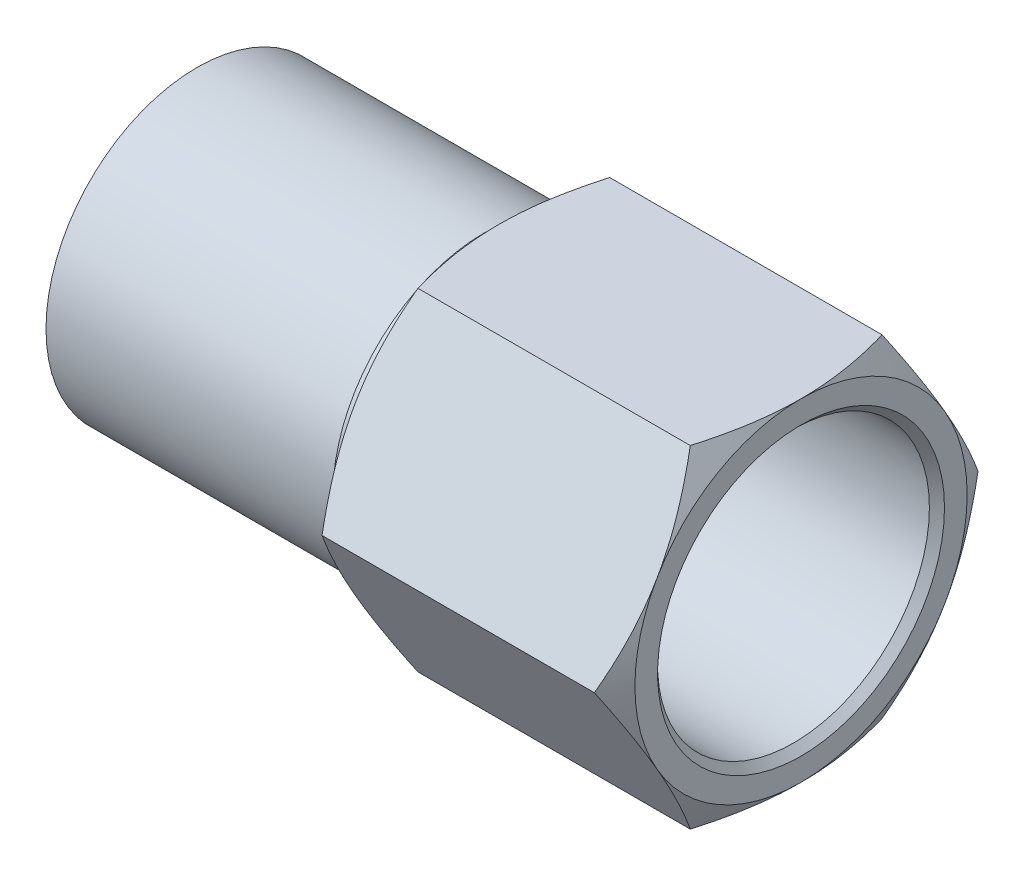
ISO-10303-21;
HEADER;
FILE_DESCRIPTION(('STEP AP214'),'2;1');
FILE_NAME('part.step','',(''),(''),'','','');
FILE_SCHEMA(('AUTOMOTIVE_DESIGN { 1 0 10303 214 1 1 1 1 }'));
ENDSEC;
DATA;
#1=APPLICATION_CONTEXT('core data for automotive mechanical design processes');
#2=APPLICATION_PROTOCOL_DEFINITION('international standard','automotive_design',2000,#1);
#3=PRODUCT_CONTEXT('',#1,'mechanical');
#4=PRODUCT('Part','Part','',(#3));
#5=PRODUCT_RELATED_PRODUCT_CATEGORY('part','',(#4));
#6=PRODUCT_DEFINITION_FORMATION('','',#4);
#7=PRODUCT_DEFINITION_CONTEXT('part definition',#1,'design');
#8=PRODUCT_DEFINITION('design','',#6,#7);
#9=PRODUCT_DEFINITION_SHAPE('','',#8);
#10=(LENGTH_UNIT() NAMED_UNIT(*) SI_UNIT(.MILLI.,.METRE.));
#11=(NAMED_UNIT(*) PLANE_ANGLE_UNIT() SI_UNIT($,.RADIAN.));
#12=(NAMED_UNIT(*) SI_UNIT($,.STERADIAN.) SOLID_ANGLE_UNIT());
#13=UNCERTAINTY_MEASURE_WITH_UNIT(LENGTH_MEASURE(1.E-05),#10,'distance_accuracy_value','');
#14=(GEOMETRIC_REPRESENTATION_CONTEXT(3) GLOBAL_UNCERTAINTY_ASSIGNED_CONTEXT((#13)) GLOBAL_UNIT_ASSIGNED_CONTEXT((#10,
#11,#12)) REPRESENTATION_CONTEXT('',''));
#15=CARTESIAN_POINT('',(0.,0.,0.));
#16=DIRECTION('',(0.,0.,1.));
#17=DIRECTION('',(1.,0.,0.));
#18=AXIS2_PLACEMENT_3D('',#15,#16,#17);
#19=CARTESIAN_POINT('',(-20.,0.,0.));
#20=DIRECTION('',(1.,0.,0.));
#21=DIRECTION('',(0.,0.,-1.));
#22=AXIS2_PLACEMENT_3D('',#19,#20,#21);
#23=CYLINDRICAL_SURFACE('',#22,10.);
#24=CARTESIAN_POINT('',(-1.,0.,0.));
#25=DIRECTION('',(1.,0.,0.));
#26=DIRECTION('',(0.,0.,-1.));
#27=AXIS2_PLACEMENT_3D('',#24,#25,#26);
#28=CIRCLE('',#27,10.);
#29=CARTESIAN_POINT('',(-1.,0.,-10.));
#30=VERTEX_POINT('',#29);
#31=EDGE_CURVE('P0_E15',#30,#30,#28,.F.);
#32=ORIENTED_EDGE('',*,*,#31,.T.);
#33=EDGE_LOOP('',(#32));
#34=FACE_BOUND('',#33,.T.);
#35=CARTESIAN_POINT('',(-20.,0.,0.));
#36=DIRECTION('',(1.,0.,0.));
#37=DIRECTION('',(0.,0.,-1.));
#38=AXIS2_PLACEMENT_3D('',#35,#36,#37);
#39=CIRCLE('',#38,10.);
#40=CARTESIAN_POINT('',(-20.,0.,-10.));
#41=VERTEX_POINT('',#40);
#42=EDGE_CURVE('P0_E10',#41,#41,#39,.T.);
#43=ORIENTED_EDGE('',*,*,#42,.T.);
#44=EDGE_LOOP('',(#43));
#45=FACE_BOUND('',#44,.T.);
#46=ADVANCED_FACE('P0_F14',(#34,#45),#23,.T.);
#47=OPEN_SHELL('',(#46));
#48=SHELL_BASED_SURFACE_MODEL('P0_B1',(#47));
#49=CARTESIAN_POINT('',(20.,0.,0.));
#50=DIRECTION('',(-1.,0.,0.));
#51=DIRECTION('',(0.,0.,1.));
#52=AXIS2_PLACEMENT_3D('',#49,#50,#51);
#53=CYLINDRICAL_SURFACE('',#52,10.);
#54=CARTESIAN_POINT('',(5.,0.,0.));
#55=DIRECTION('',(-1.,0.,0.));
#56=DIRECTION('',(0.,0.,1.));
#57=AXIS2_PLACEMENT_3D('',#54,#55,#56);
#58=CIRCLE('',#57,10.);
#59=CARTESIAN_POINT('',(5.,0.,10.));
#60=VERTEX_POINT('',#59);
#61=EDGE_CURVE('P1_E15',#60,#60,#58,.F.);
#62=ORIENTED_EDGE('',*,*,#61,.T.);
#63=EDGE_LOOP('',(#62));
#64=FACE_BOUND('',#63,.T.);
#65=CARTESIAN_POINT('',(20.,0.,0.));
#66=DIRECTION('',(-1.,0.,0.));
#67=DIRECTION('',(0.,0.,1.));
#68=AXIS2_PLACEMENT_3D('',#65,#66,#67);
#69=CIRCLE('',#68,10.);
#70=CARTESIAN_POINT('',(20.,0.,10.));
#71=VERTEX_POINT('',#70);
#72=EDGE_CURVE('P1_E10',#71,#71,#69,.T.);
#73=ORIENTED_EDGE('',*,*,#72,.T.);
#74=EDGE_LOOP('',(#73));
#75=FACE_BOUND('',#74,.T.);
#76=ADVANCED_FACE('P1_F14',(#64,#75),#53,.T.);
#77=OPEN_SHELL('',(#76));
#78=SHELL_BASED_SURFACE_MODEL('P1_B1',(#77));
#79=CARTESIAN_POINT('',(20.,0.,0.));
#80=DIRECTION('',(1.,0.,0.));
#81=DIRECTION('',(0.,0.,-1.));
#82=AXIS2_PLACEMENT_3D('',#79,#80,#81);
#83=CONICAL_SURFACE('',#82,9.5,0.785398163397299);
#84=CARTESIAN_POINT('',(19.5,0.,0.));
#85=DIRECTION('',(1.,0.,0.));
#86=DIRECTION('',(0.,0.,-1.));
#87=AXIS2_PLACEMENT_3D('',#84,#85,#86);
#88=CIRCLE('',#87,9.);
#89=CARTESIAN_POINT('',(19.5,0.,-9.));
#90=VERTEX_POINT('',#89);
#91=EDGE_CURVE('P2_E311',#90,#90,#88,.F.);
#92=ORIENTED_EDGE('',*,*,#91,.T.);
#93=EDGE_LOOP('',(#92));
#94=FACE_BOUND('',#93,.T.);
#95=CARTESIAN_POINT('',(20.,0.,0.));
#96=DIRECTION('',(1.,0.,0.));
#97=DIRECTION('',(0.,0.,-1.));
#98=AXIS2_PLACEMENT_3D('',#95,#96,#97);
#99=CIRCLE('',#98,9.5);
#100=CARTESIAN_POINT('',(20.,0.,-9.5));
#101=VERTEX_POINT('',#100);
#102=EDGE_CURVE('P2_E19',#101,#101,#99,.F.);
#103=ORIENTED_EDGE('',*,*,#102,.F.);
#104=EDGE_LOOP('',(#103));
#105=FACE_BOUND('',#104,.T.);
#106=ADVANCED_FACE('P2_F16',(#94,#105),#83,.F.);
#107=CARTESIAN_POINT('',(20.,0.,0.));
#108=DIRECTION('',(1.,0.,0.));
#109=DIRECTION('',(0.,0.,-1.));
#110=AXIS2_PLACEMENT_3D('',#107,#108,#109);
#111=CYLINDRICAL_SURFACE('',#110,9.);
#112=CARTESIAN_POINT('',(5.,0.,0.));
#113=DIRECTION('',(1.,0.,0.));
#114=DIRECTION('',(0.,0.,-1.));
#115=AXIS2_PLACEMENT_3D('',#112,#113,#114);
#116=CIRCLE('',#115,9.);
#117=CARTESIAN_POINT('',(5.,0.,-9.));
#118=VERTEX_POINT('',#117);
#119=EDGE_CURVE('P2_E111',#118,#118,#116,.T.);
#120=ORIENTED_EDGE('',*,*,#119,.F.);
#121=EDGE_LOOP('',(#120));
#122=FACE_BOUND('',#121,.T.);
#123=ORIENTED_EDGE('',*,*,#91,.F.);
#124=EDGE_LOOP('',(#123));
#125=FACE_BOUND('',#124,.T.);
#126=ADVANCED_FACE('P2_F678',(#122,#125),#111,.F.);
#127=CARTESIAN_POINT('',(20.,0.,0.));
#128=DIRECTION('',(1.,0.,0.));
#129=DIRECTION('',(0.,0.,-1.));
#130=AXIS2_PLACEMENT_3D('',#127,#128,#129);
#131=PLANE('',#130);
#132=ORIENTED_EDGE('',*,*,#102,.T.);
#133=EDGE_LOOP('',(#132));
#134=FACE_BOUND('',#133,.T.);
#135=CARTESIAN_POINT('',(20.0000000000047,0.,0.));
#136=DIRECTION('',(-1.,0.,0.));
#137=DIRECTION('',(0.,0.,1.));
#138=AXIS2_PLACEMENT_3D('',#135,#136,#137);
#139=CIRCLE('',#138,11.0000000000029);
#140=CARTESIAN_POINT('',(20.0000000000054,5.50000000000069,9.5262794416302));
#141=VERTEX_POINT('',#140);
#142=CARTESIAN_POINT('',(20.0000000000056,11.0000000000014,0.));
#143=VERTEX_POINT('',#142);
#144=EDGE_CURVE('P2_E303',#141,#143,#139,.T.);
#145=ORIENTED_EDGE('',*,*,#144,.F.);
#146=CARTESIAN_POINT('',(20.0000000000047,0.,0.));
#147=DIRECTION('',(-1.,0.,0.));
#148=DIRECTION('',(0.,0.,1.));
#149=AXIS2_PLACEMENT_3D('',#146,#147,#148);
#150=CIRCLE('',#149,11.0000000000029);
#151=CARTESIAN_POINT('',(20.000000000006,-5.50000000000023,9.52627944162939));
#152=VERTEX_POINT('',#151);
#153=EDGE_CURVE('P2_E107',#152,#141,#150,.T.);
#154=ORIENTED_EDGE('',*,*,#153,.F.);
#155=CARTESIAN_POINT('',(20.0000000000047,0.,0.));
#156=DIRECTION('',(-1.,0.,0.));
#157=DIRECTION('',(0.,0.,1.));
#158=AXIS2_PLACEMENT_3D('',#155,#156,#157);
#159=CIRCLE('',#158,11.0000000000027);
#160=CARTESIAN_POINT('',(20.0000000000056,-11.0000000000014,0.));
#161=VERTEX_POINT('',#160);
#162=EDGE_CURVE('P2_E101',#161,#152,#159,.T.);
#163=ORIENTED_EDGE('',*,*,#162,.F.);
#164=CARTESIAN_POINT('',(20.0000000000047,0.,0.));
#165=DIRECTION('',(-1.,0.,0.));
#166=DIRECTION('',(0.,0.,1.));
#167=AXIS2_PLACEMENT_3D('',#164,#165,#166);
#168=CIRCLE('',#167,11.0000000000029);
#169=CARTESIAN_POINT('',(20.0000000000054,-5.50000000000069,-9.5262794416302));
#170=VERTEX_POINT('',#169);
#171=EDGE_CURVE('P2_E104',#170,#161,#168,.T.);
#172=ORIENTED_EDGE('',*,*,#171,.F.);
#173=CARTESIAN_POINT('',(20.0000000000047,0.,0.));
#174=DIRECTION('',(-1.,0.,0.));
#175=DIRECTION('',(0.,0.,1.));
#176=AXIS2_PLACEMENT_3D('',#173,#174,#175);
#177=CIRCLE('',#176,11.0000000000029);
#178=CARTESIAN_POINT('',(20.000000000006,5.50000000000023,-9.52627944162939));
#179=VERTEX_POINT('',#178);
#180=EDGE_CURVE('P2_E122',#179,#170,#177,.T.);
#181=ORIENTED_EDGE('',*,*,#180,.F.);
#182=CARTESIAN_POINT('',(20.0000000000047,0.,0.));
#183=DIRECTION('',(-1.,0.,0.));
#184=DIRECTION('',(0.,0.,1.));
#185=AXIS2_PLACEMENT_3D('',#182,#183,#184);
#186=CIRCLE('',#185,11.0000000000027);
#187=EDGE_CURVE('P2_E300',#143,#179,#186,.T.);
#188=ORIENTED_EDGE('',*,*,#187,.F.);
#189=EDGE_LOOP('',(#145,#154,#163,#172,#181,#188));
#190=FACE_BOUND('',#189,.T.);
#191=ADVANCED_FACE('P2_F103',(#134,#190),#131,.T.);
#192=CARTESIAN_POINT('',(5.,0.,0.));
#193=DIRECTION('',(1.,0.,0.));
#194=DIRECTION('',(0.,0.,-1.));
#195=AXIS2_PLACEMENT_3D('',#192,#193,#194);
#196=PLANE('',#195);
#197=CARTESIAN_POINT('',(5.,0.,0.));
#198=DIRECTION('',(1.,0.,0.));
#199=DIRECTION('',(0.,0.,-1.));
#200=AXIS2_PLACEMENT_3D('',#197,#198,#199);
#201=CIRCLE('',#200,4.);
#202=CARTESIAN_POINT('',(5.,0.,-4.));
#203=VERTEX_POINT('',#202);
#204=EDGE_CURVE('P2_E297',#203,#203,#201,.F.);
#205=ORIENTED_EDGE('',*,*,#204,.T.);
#206=EDGE_LOOP('',(#205));
#207=FACE_BOUND('',#206,.T.);
#208=ORIENTED_EDGE('',*,*,#119,.T.);
#209=EDGE_LOOP('',(#208));
#210=FACE_BOUND('',#209,.T.);
#211=ADVANCED_FACE('P2_F662',(#207,#210),#196,.T.);
#212=CARTESIAN_POINT('',(19.0116247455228,0.,0.));
#213=DIRECTION('',(-1.,0.,0.));
#214=DIRECTION('',(0.,0.,1.));
#215=AXIS2_PLACEMENT_3D('',#212,#213,#214);
#216=CONICAL_SURFACE('',#215,12.7119161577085,1.0471975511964);
#217=CARTESIAN_POINT('',(20.0000000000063,-11.,0.));
#218=CARTESIAN_POINT('',(20.000045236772,-11.,0.269557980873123));
#219=CARTESIAN_POINT('',(19.9942806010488,-11.,0.539103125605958));
#220=CARTESIAN_POINT('',(19.9714665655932,-11.,1.07766415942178));
#221=CARTESIAN_POINT('',(19.9544193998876,-11.,1.34668014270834));
#222=CARTESIAN_POINT('',(19.9094875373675,-11.,1.88244492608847));
#223=CARTESIAN_POINT('',(19.8816573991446,-11.,2.14919833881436));
#224=CARTESIAN_POINT('',(19.8157540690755,-11.,2.68143544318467));
#225=CARTESIAN_POINT('',(19.7776806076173,-11.,2.94691910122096));
#226=CARTESIAN_POINT('',(19.6920670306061,-11.,3.47602104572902));
#227=CARTESIAN_POINT('',(19.6445383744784,-11.,3.73964119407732));
#228=CARTESIAN_POINT('',(19.540795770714,-11.,4.26516474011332));
#229=CARTESIAN_POINT('',(19.4845812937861,-11.,4.52706803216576));
#230=CARTESIAN_POINT('',(19.3035576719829,-11.,5.31266890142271));
#231=CARTESIAN_POINT('',(19.1668042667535,-11.,5.83365891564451));
#232=CARTESIAN_POINT('',(19.0175196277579,-11.,6.35085296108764));
#233=B_SPLINE_CURVE_WITH_KNOTS('',3,(#217,#218,#219,#220,#221,#222,#223,#224,#225,#226,#227,
#228,#229,#230,#231,#232),.UNSPECIFIED.,.F.,.F.,(4,2,2,2,2,2,2,4),(0.,0.80859171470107,
1.61702336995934,2.42141692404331,3.22583165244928,4.02927732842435,4.83277198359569,
6.44765263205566),.UNSPECIFIED.);
#234=CARTESIAN_POINT('',(19.0175196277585,-11.0000000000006,6.35085296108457));
#235=VERTEX_POINT('',#234);
#236=EDGE_CURVE('P2_E125',#161,#235,#233,.T.);
#237=ORIENTED_EDGE('',*,*,#236,.F.);
#238=ORIENTED_EDGE('',*,*,#162,.T.);
#239=CARTESIAN_POINT('',(19.0175196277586,-11.0000000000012,6.35085296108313));
#240=CARTESIAN_POINT('',(19.1668042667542,-10.5520968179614,6.60944998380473));
#241=CARTESIAN_POINT('',(19.3035576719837,-10.1009062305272,6.86994499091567));
#242=CARTESIAN_POINT('',(19.484581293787,-9.42055592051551,7.2627454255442));
#243=CARTESIAN_POINT('',(19.5407957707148,-9.1937410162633,7.39369707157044));
#244=CARTESIAN_POINT('',(19.6445383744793,-8.73862427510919,7.65645884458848));
#245=CARTESIAN_POINT('',(19.692067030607,-8.51032252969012,7.78826891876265));
#246=CARTESIAN_POINT('',(19.7776806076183,-8.05210680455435,8.05281989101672));
#247=CARTESIAN_POINT('',(19.8157540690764,-7.82219121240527,8.18556172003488));
#248=CARTESIAN_POINT('',(19.8816573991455,-7.36126035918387,8.45168027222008));
#249=CARTESIAN_POINT('',(19.9094875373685,-7.13024512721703,8.58505697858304));
#250=CARTESIAN_POINT('',(19.9544193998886,-6.66625921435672,8.85293937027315));
#251=CARTESIAN_POINT('',(19.9714665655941,-6.43328453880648,8.98744736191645));
#252=CARTESIAN_POINT('',(19.9942806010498,-5.96687700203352,9.2567278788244));
#253=CARTESIAN_POINT('',(20.000045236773,-5.73344405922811,9.39150045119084));
#254=CARTESIAN_POINT('',(20.0000000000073,-5.4999999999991,9.52627944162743));
#255=B_SPLINE_CURVE_WITH_KNOTS('',3,(#239,#240,#241,#242,#243,#244,#245,#246,#247,#248,#249,
#250,#251,#252,#253,#254),.UNSPECIFIED.,.F.,.F.,(4,2,2,2,2,2,2,4),(0.,1.61488064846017,
2.41837530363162,3.22182097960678,4.02623570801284,4.83062926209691,5.63906091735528,
6.44765263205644),.UNSPECIFIED.);
#256=EDGE_CURVE('P2_E128',#235,#152,#255,.T.);
#257=ORIENTED_EDGE('',*,*,#256,.F.);
#258=EDGE_LOOP('',(#237,#238,#257));
#259=FACE_BOUND('',#258,.T.);
#260=ADVANCED_FACE('P2_F126',(#259),#216,.T.);
#261=CARTESIAN_POINT('',(19.0116247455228,0.,0.));
#262=DIRECTION('',(-1.,0.,0.));
#263=DIRECTION('',(0.,0.,1.));
#264=AXIS2_PLACEMENT_3D('',#261,#262,#263);
#265=CONICAL_SURFACE('',#264,12.7119161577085,1.0471975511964);
#266=CARTESIAN_POINT('',(20.0000000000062,-5.5,-9.52627944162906));
#267=CARTESIAN_POINT('',(20.0000452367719,-5.733444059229,-9.39150045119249));
#268=CARTESIAN_POINT('',(19.9942806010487,-5.96687700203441,-9.25672787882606));
#269=CARTESIAN_POINT('',(19.9714665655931,-6.43328453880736,-8.98744736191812));
#270=CARTESIAN_POINT('',(19.9544193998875,-6.66625921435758,-8.85293937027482));
#271=CARTESIAN_POINT('',(19.9094875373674,-7.13024512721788,-8.58505697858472));
#272=CARTESIAN_POINT('',(19.8816573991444,-7.36126035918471,-8.45168027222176));
#273=CARTESIAN_POINT('',(19.8157540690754,-7.8221912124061,-8.18556172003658));
#274=CARTESIAN_POINT('',(19.7776806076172,-8.05210680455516,-8.05281989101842));
#275=CARTESIAN_POINT('',(19.6920670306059,-8.51032252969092,-7.78826891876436));
#276=CARTESIAN_POINT('',(19.6445383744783,-8.73862427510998,-7.6564588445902));
#277=CARTESIAN_POINT('',(19.5407957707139,-9.19374101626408,-7.39369707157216));
#278=CARTESIAN_POINT('',(19.484581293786,-9.42055592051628,-7.26274542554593));
#279=CARTESIAN_POINT('',(19.3035576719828,-10.100906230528,-6.86994499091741));
#280=CARTESIAN_POINT('',(19.1668042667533,-10.5520968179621,-6.60944998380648));
#281=CARTESIAN_POINT('',(19.0175196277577,-11.0000000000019,-6.35085296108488));
#282=B_SPLINE_CURVE_WITH_KNOTS('',3,(#266,#267,#268,#269,#270,#271,#272,#273,#274,#275,#276,
#277,#278,#279,#280,#281),.UNSPECIFIED.,.F.,.F.,(4,2,2,2,2,2,2,4),(0.,0.808591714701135,
1.61702336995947,2.42141692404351,3.22583165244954,4.02927732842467,4.83277198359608,
6.44765263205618),.UNSPECIFIED.);
#283=CARTESIAN_POINT('',(19.0175196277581,-11.,-6.35085296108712));
#284=VERTEX_POINT('',#283);
#285=EDGE_CURVE('P2_E120',#170,#284,#282,.T.);
#286=ORIENTED_EDGE('',*,*,#285,.F.);
#287=ORIENTED_EDGE('',*,*,#171,.T.);
#288=CARTESIAN_POINT('',(19.0175196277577,-11.,-6.35085296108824));
#289=CARTESIAN_POINT('',(19.1668042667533,-11.,-5.83365891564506));
#290=CARTESIAN_POINT('',(19.3035576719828,-11.,-5.31266890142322));
#291=CARTESIAN_POINT('',(19.484581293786,-11.,-4.52706803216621));
#292=CARTESIAN_POINT('',(19.5407957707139,-11.,-4.26516474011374));
#293=CARTESIAN_POINT('',(19.6445383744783,-11.,-3.73964119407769));
#294=CARTESIAN_POINT('',(19.692067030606,-11.,-3.47602104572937));
#295=CARTESIAN_POINT('',(19.7776806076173,-11.,-2.94691910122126));
#296=CARTESIAN_POINT('',(19.8157540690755,-11.,-2.68143544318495));
#297=CARTESIAN_POINT('',(19.8816573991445,-11.,-2.14919833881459));
#298=CARTESIAN_POINT('',(19.9094875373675,-11.,-1.88244492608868));
#299=CARTESIAN_POINT('',(19.9544193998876,-11.,-1.3466801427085));
#300=CARTESIAN_POINT('',(19.9714665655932,-11.,-1.07766415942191));
#301=CARTESIAN_POINT('',(19.9942806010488,-11.,-0.539103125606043));
#302=CARTESIAN_POINT('',(20.000045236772,-11.,-0.269557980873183));
#303=CARTESIAN_POINT('',(20.0000000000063,-11.,0.));
#304=B_SPLINE_CURVE_WITH_KNOTS('',3,(#288,#289,#290,#291,#292,#293,#294,#295,#296,#297,#298,
#299,#300,#301,#302,#303),.UNSPECIFIED.,.F.,.F.,(4,2,2,2,2,2,2,4),(0.,1.61488064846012,
2.41837530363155,3.22182097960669,4.02623570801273,4.83062926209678,5.63906091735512,
6.44765263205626),.UNSPECIFIED.);
#305=EDGE_CURVE('P2_E117',#284,#161,#304,.T.);
#306=ORIENTED_EDGE('',*,*,#305,.F.);
#307=EDGE_LOOP('',(#286,#287,#306));
#308=FACE_BOUND('',#307,.T.);
#309=ADVANCED_FACE('P2_F115',(#308),#265,.T.);
#310=CARTESIAN_POINT('',(19.0116247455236,0.,0.));
#311=DIRECTION('',(-1.,0.,0.));
#312=DIRECTION('',(0.,0.,1.));
#313=AXIS2_PLACEMENT_3D('',#310,#311,#312);
#314=CONICAL_SURFACE('',#313,12.7119161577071,1.0471975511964);
#315=CARTESIAN_POINT('',(20.0000000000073,5.4999999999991,-9.52627944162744));
#316=CARTESIAN_POINT('',(20.0000452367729,5.2665559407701,-9.66105843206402));
#317=CARTESIAN_POINT('',(19.9942806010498,5.0331229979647,-9.79583100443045));
#318=CARTESIAN_POINT('',(19.9714665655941,4.56671546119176,-10.0651115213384));
#319=CARTESIAN_POINT('',(19.9544193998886,4.33374078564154,-10.1996195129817));
#320=CARTESIAN_POINT('',(19.9094875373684,3.86975487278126,-10.4675019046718));
#321=CARTESIAN_POINT('',(19.8816573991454,3.63873964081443,-10.6008786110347));
#322=CARTESIAN_POINT('',(19.8157540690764,3.17780878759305,-10.8669971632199));
#323=CARTESIAN_POINT('',(19.7776806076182,2.94789319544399,-10.9997389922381));
#324=CARTESIAN_POINT('',(19.6920670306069,2.48967747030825,-11.2642899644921));
#325=CARTESIAN_POINT('',(19.6445383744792,2.26137572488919,-11.3961000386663));
#326=CARTESIAN_POINT('',(19.5407957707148,1.8062589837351,-11.6588618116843));
#327=CARTESIAN_POINT('',(19.4845812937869,1.57944407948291,-11.7898134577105));
#328=CARTESIAN_POINT('',(19.3035576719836,0.899093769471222,-12.1826138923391));
#329=CARTESIAN_POINT('',(19.1668042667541,0.447903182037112,-12.44310889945));
#330=CARTESIAN_POINT('',(19.0175196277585,-2.69836580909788E-12,-12.7017059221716));
#331=B_SPLINE_CURVE_WITH_KNOTS('',3,(#315,#316,#317,#318,#319,#320,#321,#322,#323,#324,#325,
#326,#327,#328,#329,#330),.UNSPECIFIED.,.F.,.F.,(4,2,2,2,2,2,2,4),(0.,0.808591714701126,
1.61702336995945,2.42141692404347,3.22583165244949,4.02927732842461,4.83277198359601,
6.4476526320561),.UNSPECIFIED.);
#332=CARTESIAN_POINT('',(19.0175196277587,5.1315977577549E-13,-12.7017059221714));
#333=VERTEX_POINT('',#332);
#334=EDGE_CURVE('P2_E417',#179,#333,#331,.T.);
#335=ORIENTED_EDGE('',*,*,#334,.F.);
#336=ORIENTED_EDGE('',*,*,#180,.T.);
#337=CARTESIAN_POINT('',(19.0175196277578,1.02659279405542E-12,-12.7017059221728));
#338=CARTESIAN_POINT('',(19.1668042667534,-0.447903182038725,-12.4431088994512));
#339=CARTESIAN_POINT('',(19.3035576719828,-0.899093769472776,-12.1826138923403));
#340=CARTESIAN_POINT('',(19.484581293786,-1.57944407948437,-11.7898134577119));
#341=CARTESIAN_POINT('',(19.5407957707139,-1.80625898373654,-11.6588618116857));
#342=CARTESIAN_POINT('',(19.6445383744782,-2.26137572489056,-11.3961000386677));
#343=CARTESIAN_POINT('',(19.6920670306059,-2.48967747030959,-11.2642899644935));
#344=CARTESIAN_POINT('',(19.7776806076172,-2.94789319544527,-10.9997389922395));
#345=CARTESIAN_POINT('',(19.8157540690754,-3.1778087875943,-10.8669971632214));
#346=CARTESIAN_POINT('',(19.8816573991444,-3.63873964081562,-10.6008786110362));
#347=CARTESIAN_POINT('',(19.9094875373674,-3.86975487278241,-10.4675019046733));
#348=CARTESIAN_POINT('',(19.9544193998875,-4.33374078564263,-10.1996195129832));
#349=CARTESIAN_POINT('',(19.971466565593,-4.56671546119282,-10.06511152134));
#350=CARTESIAN_POINT('',(19.9942806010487,-5.03312299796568,-9.79583100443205));
#351=CARTESIAN_POINT('',(20.0000452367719,-5.26655594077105,-9.66105843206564));
#352=CARTESIAN_POINT('',(20.0000000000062,-5.5,-9.52627944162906));
#353=B_SPLINE_CURVE_WITH_KNOTS('',3,(#337,#338,#339,#340,#341,#342,#343,#344,#345,#346,#347,
#348,#349,#350,#351,#352),.UNSPECIFIED.,.F.,.F.,(4,2,2,2,2,2,2,4),(0.,1.61488064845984,
2.41837530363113,3.22182097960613,4.02623570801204,4.83062926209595,5.63906091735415,
6.44765263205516),.UNSPECIFIED.);
#354=EDGE_CURVE('P2_E176',#333,#170,#353,.T.);
#355=ORIENTED_EDGE('',*,*,#354,.F.);
#356=EDGE_LOOP('',(#335,#336,#355));
#357=FACE_BOUND('',#356,.T.);
#358=ADVANCED_FACE('P2_F164',(#357),#314,.T.);
#359=CARTESIAN_POINT('',(19.0116247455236,0.,0.));
#360=DIRECTION('',(-1.,0.,0.));
#361=DIRECTION('',(0.,0.,1.));
#362=AXIS2_PLACEMENT_3D('',#359,#360,#361);
#363=CONICAL_SURFACE('',#362,12.7119161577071,1.0471975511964);
#364=CARTESIAN_POINT('',(20.0000000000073,-5.4999999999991,9.52627944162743));
#365=CARTESIAN_POINT('',(20.0000452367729,-5.2665559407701,9.66105843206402));
#366=CARTESIAN_POINT('',(19.9942806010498,-5.03312299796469,9.79583100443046));
#367=CARTESIAN_POINT('',(19.9714665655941,-4.56671546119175,10.0651115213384));
#368=CARTESIAN_POINT('',(19.9544193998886,-4.33374078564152,10.1996195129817));
#369=CARTESIAN_POINT('',(19.9094875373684,-3.86975487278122,10.4675019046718));
#370=CARTESIAN_POINT('',(19.8816573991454,-3.63873964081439,10.6008786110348));
#371=CARTESIAN_POINT('',(19.8157540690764,-3.177808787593,10.8669971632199));
#372=CARTESIAN_POINT('',(19.7776806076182,-2.94789319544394,10.9997389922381));
#373=CARTESIAN_POINT('',(19.6920670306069,-2.48967747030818,11.2642899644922));
#374=CARTESIAN_POINT('',(19.6445383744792,-2.26137572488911,11.3961000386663));
#375=CARTESIAN_POINT('',(19.5407957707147,-1.80625898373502,11.6588618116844));
#376=CARTESIAN_POINT('',(19.4845812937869,-1.57944407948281,11.7898134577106));
#377=CARTESIAN_POINT('',(19.3035576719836,-0.899093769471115,12.1826138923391));
#378=CARTESIAN_POINT('',(19.1668042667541,-0.447903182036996,12.44310889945));
#379=CARTESIAN_POINT('',(19.0175196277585,2.82988278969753E-12,12.7017059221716));
#380=B_SPLINE_CURVE_WITH_KNOTS('',3,(#364,#365,#366,#367,#368,#369,#370,#371,#372,#373,#374,
#375,#376,#377,#378,#379),.UNSPECIFIED.,.F.,.F.,(4,2,2,2,2,2,2,4),(0.,0.808591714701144,
1.61702336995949,2.42141692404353,3.22583165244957,4.02927732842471,4.83277198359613,
6.44765263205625),.UNSPECIFIED.);
#381=CARTESIAN_POINT('',(19.0175196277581,8.36742042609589E-13,12.7017059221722));
#382=VERTEX_POINT('',#381);
#383=EDGE_CURVE('P2_E137',#152,#382,#380,.T.);
#384=ORIENTED_EDGE('',*,*,#383,.F.);
#385=ORIENTED_EDGE('',*,*,#153,.T.);
#386=CARTESIAN_POINT('',(19.0175196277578,-1.15623173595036E-12,12.7017059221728));
#387=CARTESIAN_POINT('',(19.1668042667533,0.447903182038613,12.4431088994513));
#388=CARTESIAN_POINT('',(19.3035576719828,0.899093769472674,12.1826138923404));
#389=CARTESIAN_POINT('',(19.484581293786,1.57944407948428,11.7898134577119));
#390=CARTESIAN_POINT('',(19.5407957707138,1.80625898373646,11.6588618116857));
#391=CARTESIAN_POINT('',(19.6445383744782,2.26137572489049,11.3961000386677));
#392=CARTESIAN_POINT('',(19.6920670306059,2.48967747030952,11.2642899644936));
#393=CARTESIAN_POINT('',(19.7776806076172,2.94789319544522,10.9997389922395));
#394=CARTESIAN_POINT('',(19.8157540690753,3.17780878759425,10.8669971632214));
#395=CARTESIAN_POINT('',(19.8816573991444,3.63873964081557,10.6008786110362));
#396=CARTESIAN_POINT('',(19.9094875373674,3.86975487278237,10.4675019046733));
#397=CARTESIAN_POINT('',(19.9544193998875,4.3337407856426,10.1996195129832));
#398=CARTESIAN_POINT('',(19.971466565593,4.56671546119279,10.06511152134));
#399=CARTESIAN_POINT('',(19.9942806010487,5.03312299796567,9.79583100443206));
#400=CARTESIAN_POINT('',(20.0000452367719,5.26655594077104,9.66105843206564));
#401=CARTESIAN_POINT('',(20.0000000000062,5.5,9.52627944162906));
#402=B_SPLINE_CURVE_WITH_KNOTS('',3,(#386,#387,#388,#389,#390,#391,#392,#393,#394,#395,#396,
#397,#398,#399,#400,#401),.UNSPECIFIED.,.F.,.F.,(4,2,2,2,2,2,2,4),(0.,1.61488064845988,
2.41837530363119,3.22182097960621,4.02623570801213,4.83062926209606,5.63906091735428,
6.44765263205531),.UNSPECIFIED.);
#403=EDGE_CURVE('P2_E410',#382,#141,#402,.T.);
#404=ORIENTED_EDGE('',*,*,#403,.F.);
#405=EDGE_LOOP('',(#384,#385,#404));
#406=FACE_BOUND('',#405,.T.);
#407=ADVANCED_FACE('P2_F399',(#406),#363,.T.);
#408=CARTESIAN_POINT('',(19.0116247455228,0.,0.));
#409=DIRECTION('',(-1.,0.,0.));
#410=DIRECTION('',(0.,0.,1.));
#411=AXIS2_PLACEMENT_3D('',#408,#409,#410);
#412=CONICAL_SURFACE('',#411,12.7119161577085,1.0471975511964);
#413=CARTESIAN_POINT('',(20.0000000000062,5.5,9.52627944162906));
#414=CARTESIAN_POINT('',(20.0000452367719,5.733444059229,9.39150045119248));
#415=CARTESIAN_POINT('',(19.9942806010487,5.96687700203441,9.25672787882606));
#416=CARTESIAN_POINT('',(19.9714665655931,6.43328453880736,8.98744736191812));
#417=CARTESIAN_POINT('',(19.9544193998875,6.66625921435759,8.85293937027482));
#418=CARTESIAN_POINT('',(19.9094875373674,7.13024512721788,8.58505697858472));
#419=CARTESIAN_POINT('',(19.8816573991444,7.36126035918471,8.45168027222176));
#420=CARTESIAN_POINT('',(19.8157540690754,7.8221912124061,8.18556172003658));
#421=CARTESIAN_POINT('',(19.7776806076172,8.05210680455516,8.05281989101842));
#422=CARTESIAN_POINT('',(19.6920670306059,8.51032252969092,7.78826891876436));
#423=CARTESIAN_POINT('',(19.6445383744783,8.73862427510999,7.65645884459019));
#424=CARTESIAN_POINT('',(19.5407957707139,9.19374101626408,7.39369707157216));
#425=CARTESIAN_POINT('',(19.484581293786,9.42055592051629,7.26274542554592));
#426=CARTESIAN_POINT('',(19.3035576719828,10.100906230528,6.8699449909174));
#427=CARTESIAN_POINT('',(19.1668042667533,10.5520968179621,6.60944998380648));
#428=CARTESIAN_POINT('',(19.0175196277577,11.0000000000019,6.35085296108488));
#429=B_SPLINE_CURVE_WITH_KNOTS('',3,(#413,#414,#415,#416,#417,#418,#419,#420,#421,#422,#423,
#424,#425,#426,#427,#428),.UNSPECIFIED.,.F.,.F.,(4,2,2,2,2,2,2,4),(0.,0.808591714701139,
1.61702336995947,2.42141692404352,3.22583165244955,4.02927732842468,4.83277198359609,
6.4476526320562),.UNSPECIFIED.);
#430=CARTESIAN_POINT('',(19.0175196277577,11.000000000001,6.35085296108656));
#431=VERTEX_POINT('',#430);
#432=EDGE_CURVE('P2_E403',#141,#431,#429,.T.);
#433=ORIENTED_EDGE('',*,*,#432,.F.);
#434=ORIENTED_EDGE('',*,*,#144,.T.);
#435=CARTESIAN_POINT('',(19.0175196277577,11.,6.35085296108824));
#436=CARTESIAN_POINT('',(19.1668042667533,11.,5.83365891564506));
#437=CARTESIAN_POINT('',(19.3035576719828,11.,5.31266890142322));
#438=CARTESIAN_POINT('',(19.484581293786,11.,4.5270680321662));
#439=CARTESIAN_POINT('',(19.5407957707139,11.,4.26516474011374));
#440=CARTESIAN_POINT('',(19.6445383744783,11.,3.73964119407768));
#441=CARTESIAN_POINT('',(19.692067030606,11.,3.47602104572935));
#442=CARTESIAN_POINT('',(19.7776806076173,11.,2.94691910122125));
#443=CARTESIAN_POINT('',(19.8157540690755,11.,2.68143544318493));
#444=CARTESIAN_POINT('',(19.8816573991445,11.,2.14919833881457));
#445=CARTESIAN_POINT('',(19.9094875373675,11.,1.88244492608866));
#446=CARTESIAN_POINT('',(19.9544193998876,11.,1.34668014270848));
#447=CARTESIAN_POINT('',(19.9714665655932,11.,1.07766415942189));
#448=CARTESIAN_POINT('',(19.9942806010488,11.,0.539103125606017));
#449=CARTESIAN_POINT('',(20.000045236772,11.,0.269557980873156));
#450=CARTESIAN_POINT('',(20.0000000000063,11.,0.));
#451=B_SPLINE_CURVE_WITH_KNOTS('',3,(#435,#436,#437,#438,#439,#440,#441,#442,#443,#444,#445,
#446,#447,#448,#449,#450),.UNSPECIFIED.,.F.,.F.,(4,2,2,2,2,2,2,4),(0.,1.61488064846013,
2.41837530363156,3.2218209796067,4.02623570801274,4.8306292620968,5.63906091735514,
6.44765263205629),.UNSPECIFIED.);
#452=EDGE_CURVE('P2_E384',#431,#143,#451,.T.);
#453=ORIENTED_EDGE('',*,*,#452,.F.);
#454=EDGE_LOOP('',(#433,#434,#453));
#455=FACE_BOUND('',#454,.T.);
#456=ADVANCED_FACE('P2_F394',(#455),#412,.T.);
#457=CARTESIAN_POINT('',(19.0116247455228,0.,0.));
#458=DIRECTION('',(-1.,0.,0.));
#459=DIRECTION('',(0.,0.,1.));
#460=AXIS2_PLACEMENT_3D('',#457,#458,#459);
#461=CONICAL_SURFACE('',#460,12.7119161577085,1.0471975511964);
#462=CARTESIAN_POINT('',(20.0000000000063,11.,0.));
#463=CARTESIAN_POINT('',(20.000045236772,11.,-0.269557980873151));
#464=CARTESIAN_POINT('',(19.9942806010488,11.,-0.539103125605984));
#465=CARTESIAN_POINT('',(19.9714665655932,11.,-1.0776641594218));
#466=CARTESIAN_POINT('',(19.9544193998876,11.,-1.34668014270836));
#467=CARTESIAN_POINT('',(19.9094875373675,11.,-1.88244492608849));
#468=CARTESIAN_POINT('',(19.8816573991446,11.,-2.14919833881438));
#469=CARTESIAN_POINT('',(19.8157540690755,11.,-2.68143544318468));
#470=CARTESIAN_POINT('',(19.7776806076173,11.,-2.94691910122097));
#471=CARTESIAN_POINT('',(19.6920670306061,11.,-3.47602104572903));
#472=CARTESIAN_POINT('',(19.6445383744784,11.,-3.73964119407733));
#473=CARTESIAN_POINT('',(19.540795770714,11.,-4.26516474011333));
#474=CARTESIAN_POINT('',(19.4845812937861,11.,-4.52706803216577));
#475=CARTESIAN_POINT('',(19.3035576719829,11.,-5.31266890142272));
#476=CARTESIAN_POINT('',(19.1668042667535,11.,-5.83365891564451));
#477=CARTESIAN_POINT('',(19.0175196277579,11.,-6.35085296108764));
#478=B_SPLINE_CURVE_WITH_KNOTS('',3,(#462,#463,#464,#465,#466,#467,#468,#469,#470,#471,#472,
#473,#474,#475,#476,#477),.UNSPECIFIED.,.F.,.F.,(4,2,2,2,2,2,2,4),(0.,0.808591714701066,
1.61702336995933,2.4214169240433,3.22583165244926,4.02927732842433,4.83277198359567,
6.44765263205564),.UNSPECIFIED.);
#479=CARTESIAN_POINT('',(19.0175196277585,11.0000000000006,-6.35085296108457));
#480=VERTEX_POINT('',#479);
#481=EDGE_CURVE('P2_E377',#143,#480,#478,.T.);
#482=ORIENTED_EDGE('',*,*,#481,.F.);
#483=ORIENTED_EDGE('',*,*,#187,.T.);
#484=CARTESIAN_POINT('',(19.0175196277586,11.0000000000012,-6.35085296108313));
#485=CARTESIAN_POINT('',(19.1668042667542,10.5520968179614,-6.60944998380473));
#486=CARTESIAN_POINT('',(19.3035576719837,10.1009062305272,-6.86994499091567));
#487=CARTESIAN_POINT('',(19.484581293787,9.42055592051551,-7.2627454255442));
#488=CARTESIAN_POINT('',(19.5407957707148,9.1937410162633,-7.39369707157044));
#489=CARTESIAN_POINT('',(19.6445383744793,8.73862427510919,-7.65645884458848));
#490=CARTESIAN_POINT('',(19.692067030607,8.51032252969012,-7.78826891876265));
#491=CARTESIAN_POINT('',(19.7776806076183,8.05210680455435,-8.05281989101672));
#492=CARTESIAN_POINT('',(19.8157540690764,7.82219121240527,-8.18556172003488));
#493=CARTESIAN_POINT('',(19.8816573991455,7.36126035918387,-8.45168027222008));
#494=CARTESIAN_POINT('',(19.9094875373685,7.13024512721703,-8.58505697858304));
#495=CARTESIAN_POINT('',(19.9544193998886,6.66625921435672,-8.85293937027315));
#496=CARTESIAN_POINT('',(19.9714665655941,6.43328453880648,-8.98744736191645));
#497=CARTESIAN_POINT('',(19.9942806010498,5.96687700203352,-9.2567278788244));
#498=CARTESIAN_POINT('',(20.000045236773,5.73344405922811,-9.39150045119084));
#499=CARTESIAN_POINT('',(20.0000000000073,5.4999999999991,-9.52627944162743));
#500=B_SPLINE_CURVE_WITH_KNOTS('',3,(#484,#485,#486,#487,#488,#489,#490,#491,#492,#493,#494,
#495,#496,#497,#498,#499),.UNSPECIFIED.,.F.,.F.,(4,2,2,2,2,2,2,4),(0.,1.61488064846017,
2.41837530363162,3.22182097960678,4.02623570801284,4.83062926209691,5.63906091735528,
6.44765263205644),.UNSPECIFIED.);
#501=EDGE_CURVE('P2_E177',#480,#179,#500,.T.);
#502=ORIENTED_EDGE('',*,*,#501,.F.);
#503=EDGE_LOOP('',(#482,#483,#502));
#504=FACE_BOUND('',#503,.T.);
#505=ADVANCED_FACE('P2_F391',(#504),#461,.T.);
#506=CARTESIAN_POINT('',(0.,0.,0.));
#507=DIRECTION('',(1.,0.,0.));
#508=DIRECTION('',(0.,0.,-1.));
#509=AXIS2_PLACEMENT_3D('',#506,#507,#508);
#510=CYLINDRICAL_SURFACE('',#509,4.);
#511=CARTESIAN_POINT('',(0.,0.,0.));
#512=DIRECTION('',(1.,0.,0.));
#513=DIRECTION('',(0.,0.,-1.));
#514=AXIS2_PLACEMENT_3D('',#511,#512,#513);
#515=CIRCLE('',#514,4.);
#516=CARTESIAN_POINT('',(0.,0.,-4.));
#517=VERTEX_POINT('',#516);
#518=EDGE_CURVE('P2_E383',#517,#517,#515,.F.);
#519=ORIENTED_EDGE('',*,*,#518,.T.);
#520=EDGE_LOOP('',(#519));
#521=FACE_BOUND('',#520,.T.);
#522=ORIENTED_EDGE('',*,*,#204,.F.);
#523=EDGE_LOOP('',(#522));
#524=FACE_BOUND('',#523,.T.);
#525=ADVANCED_FACE('P2_F280',(#521,#524),#510,.F.);
#526=CARTESIAN_POINT('',(0.,0.,12.70170592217));
#527=DIRECTION('',(0.,-0.500000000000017,0.866025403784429));
#528=DIRECTION('',(0.,-0.866025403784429,-0.500000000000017));
#529=AXIS2_PLACEMENT_3D('',#526,#527,#528);
#530=PLANE('',#529);
#531=ORIENTED_EDGE('',*,*,#256,.T.);
#532=ORIENTED_EDGE('',*,*,#383,.T.);
#533=DIRECTION('',(1.,0.,0.));
#534=VECTOR('',#533,1.);
#535=CARTESIAN_POINT('',(0.,9.36750677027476E-13,12.7017059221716));
#536=LINE('',#535,#534);
#537=CARTESIAN_POINT('',(0.982480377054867,-1.44280949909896E-08,12.7017059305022));
#538=VERTEX_POINT('',#537);
#539=EDGE_CURVE('P2_E416',#538,#382,#536,.T.);
#540=ORIENTED_EDGE('',*,*,#539,.F.);
#541=CARTESIAN_POINT('',(-3.58130142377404E-12,-5.4999999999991,9.52627944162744));
#542=CARTESIAN_POINT('',(-4.52367667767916E-05,-5.26655594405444,9.66105843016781));
#543=CARTESIAN_POINT('',(0.00571939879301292,-5.0331230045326,9.79583100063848));
#544=CARTESIAN_POINT('',(0.0285334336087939,-4.56671547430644,10.0651115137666));
#545=CARTESIAN_POINT('',(0.0455805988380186,-4.33374080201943,10.1996195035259));
#546=CARTESIAN_POINT('',(0.0905124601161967,-3.86975489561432,10.4675018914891));
#547=CARTESIAN_POINT('',(0.118342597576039,-3.6387396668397,10.600878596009));
#548=CARTESIAN_POINT('',(0.184245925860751,-3.17780881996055,10.8669971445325));
#549=CARTESIAN_POINT('',(0.222319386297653,-2.94789323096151,10.999738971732));
#550=CARTESIAN_POINT('',(0.307932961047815,-2.48967751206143,11.2642899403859));
#551=CARTESIAN_POINT('',(0.355461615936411,-2.26137576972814,11.3961000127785));
#552=CARTESIAN_POINT('',(0.459204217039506,-1.80625903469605,11.658861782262));
#553=CARTESIAN_POINT('',(0.515418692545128,-1.57944413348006,11.7898134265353));
#554=CARTESIAN_POINT('',(0.696442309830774,-0.899093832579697,12.1826138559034));
#555=CARTESIAN_POINT('',(0.833195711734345,-0.447903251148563,12.4431088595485));
#556=CARTESIAN_POINT('',(0.982480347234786,-7.50283947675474E-08,12.7017058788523));
#557=B_SPLINE_CURVE_WITH_KNOTS('',3,(#541,#542,#543,#544,#545,#546,#547,#548,#549,#550,#551,
#552,#553,#554,#555,#556),.UNSPECIFIED.,.F.,.F.,(4,2,2,2,2,2,2,4),(0.,0.808591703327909,
1.61702334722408,2.42141689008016,3.22583160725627,4.02927727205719,4.83277191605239,
6.44765254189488),.UNSPECIFIED.);
#558=CARTESIAN_POINT('',(-2.74247746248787E-12,-5.49999999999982,9.5262794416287));
#559=VERTEX_POINT('',#558);
#560=EDGE_CURVE('P2_E285',#559,#538,#557,.T.);
#561=ORIENTED_EDGE('',*,*,#560,.F.);
#562=CARTESIAN_POINT('',(0.98248038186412,-11.0000000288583,6.35085294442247));
#563=CARTESIAN_POINT('',(0.833195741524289,-10.5520968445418,6.60944996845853));
#564=CARTESIAN_POINT('',(0.696442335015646,-10.1009062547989,6.86994497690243));
#565=CARTESIAN_POINT('',(0.515418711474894,-9.42055594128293,7.26274541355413));
#566=CARTESIAN_POINT('',(0.459204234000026,-9.19374103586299,7.39369706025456));
#567=CARTESIAN_POINT('',(0.355461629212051,-8.73862429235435,7.65645883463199));
#568=CARTESIAN_POINT('',(0.307932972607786,-8.51032254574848,7.78826890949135));
#569=CARTESIAN_POINT('',(0.222319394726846,-8.05210681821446,8.05281988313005));
#570=CARTESIAN_POINT('',(0.184245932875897,-7.82219122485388,8.18556171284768));
#571=CARTESIAN_POINT('',(0.118342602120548,-7.36126036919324,8.45168026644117));
#572=CARTESIAN_POINT('',(0.0905124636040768,-7.13024513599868,8.58505697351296));
#573=CARTESIAN_POINT('',(0.0455806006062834,-6.66625922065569,8.85293936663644));
#574=CARTESIAN_POINT('',(0.0285334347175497,-6.43328454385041,8.98744735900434));
#575=CARTESIAN_POINT('',(0.00571939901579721,-5.96687700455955,9.256727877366));
#576=CARTESIAN_POINT('',(-4.52367701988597E-05,-5.73344406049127,9.39150045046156));
#577=CARTESIAN_POINT('',(-3.58131275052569E-12,-5.4999999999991,9.52627944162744));
#578=B_SPLINE_CURVE_WITH_KNOTS('',3,(#562,#563,#564,#565,#566,#567,#568,#569,#570,#571,#572,
#573,#574,#575,#576,#577),.UNSPECIFIED.,.F.,.F.,(4,2,2,2,2,2,2,4),(0.,1.61488065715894,
2.41837531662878,3.22182099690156,4.02623572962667,4.83062928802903,5.63906094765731,
6.44765266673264),.UNSPECIFIED.);
#579=CARTESIAN_POINT('',(0.982480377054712,-11.0000000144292,6.35085295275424));
#580=VERTEX_POINT('',#579);
#581=EDGE_CURVE('P2_E257',#580,#559,#578,.T.);
#582=ORIENTED_EDGE('',*,*,#581,.F.);
#583=DIRECTION('',(1.,0.,0.));
#584=VECTOR('',#583,1.);
#585=CARTESIAN_POINT('',(0.,-11.,6.350852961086));
#586=LINE('',#585,#584);
#587=EDGE_CURVE('P2_E135',#235,#580,#586,.F.);
#588=ORIENTED_EDGE('',*,*,#587,.F.);
#589=EDGE_LOOP('',(#531,#532,#540,#561,#582,#588));
#590=FACE_BOUND('',#589,.T.);
#591=ADVANCED_FACE('P2_F276',(#590),#530,.T.);
#592=CARTESIAN_POINT('',(0.,-11.,6.350852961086));
#593=DIRECTION('',(0.,-1.,0.));
#594=DIRECTION('',(0.,0.,-1.));
#595=AXIS2_PLACEMENT_3D('',#592,#593,#594);
#596=PLANE('',#595);
#597=ORIENTED_EDGE('',*,*,#305,.T.);
#598=ORIENTED_EDGE('',*,*,#236,.T.);
#599=ORIENTED_EDGE('',*,*,#587,.T.);
#600=CARTESIAN_POINT('',(-2.62702321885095E-12,-11.,0.));
#601=CARTESIAN_POINT('',(-4.52367658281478E-05,-11.,0.269557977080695));
#602=CARTESIAN_POINT('',(0.00571939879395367,-11.,0.539103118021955));
#603=CARTESIAN_POINT('',(0.0285334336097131,-11.,1.07766414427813));
#604=CARTESIAN_POINT('',(0.0455805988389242,-11.,1.34668012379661));
#605=CARTESIAN_POINT('',(0.0905124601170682,-11.,1.88244489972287));
#606=CARTESIAN_POINT('',(0.118342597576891,-11.,2.14919830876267));
#607=CARTESIAN_POINT('',(0.184245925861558,-11.,2.68143540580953));
#608=CARTESIAN_POINT('',(0.222319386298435,-11.,2.94691906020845));
#609=CARTESIAN_POINT('',(0.307932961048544,-11.,3.4760209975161));
#610=CARTESIAN_POINT('',(0.355461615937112,-11.,3.73964114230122));
#611=CARTESIAN_POINT('',(0.459204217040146,-11.,4.26516468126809));
#612=CARTESIAN_POINT('',(0.515418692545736,-11.,4.52706796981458));
#613=CARTESIAN_POINT('',(0.69644230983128,-11.,5.31266882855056));
#614=CARTESIAN_POINT('',(0.833195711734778,-11.,5.83365883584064));
#615=CARTESIAN_POINT('',(0.982480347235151,-11.,6.35085287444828));
#616=B_SPLINE_CURVE_WITH_KNOTS('',3,(#600,#601,#602,#603,#604,#605,#606,#607,#608,#609,#610,
#611,#612,#613,#614,#615),.UNSPECIFIED.,.F.,.F.,(4,2,2,2,2,2,2,4),(0.,0.80859170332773,
1.61702334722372,2.42141689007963,3.22583160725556,4.0292772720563,4.83277191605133,
6.44765254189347),.UNSPECIFIED.);
#617=CARTESIAN_POINT('',(-2.26545261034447E-12,-11.0000000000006,0.));
#618=VERTEX_POINT('',#617);
#619=EDGE_CURVE('P2_E259',#618,#580,#616,.T.);
#620=ORIENTED_EDGE('',*,*,#619,.F.);
#621=CARTESIAN_POINT('',(0.982480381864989,-11.,-6.35085299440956));
#622=CARTESIAN_POINT('',(0.833195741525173,-11.,-5.83365894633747));
#623=CARTESIAN_POINT('',(0.696442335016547,-11.,-5.3126689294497));
#624=CARTESIAN_POINT('',(0.515418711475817,-11.,-4.52706805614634));
#625=CARTESIAN_POINT('',(0.459204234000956,-11.,-4.2651647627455));
#626=CARTESIAN_POINT('',(0.355461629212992,-11.,-3.73964121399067));
#627=CARTESIAN_POINT('',(0.307932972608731,-11.,-3.47602106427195));
#628=CARTESIAN_POINT('',(0.222319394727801,-11.,-2.94691911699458));
#629=CARTESIAN_POINT('',(0.184245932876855,-11.,-2.68143545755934));
#630=CARTESIAN_POINT('',(0.118342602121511,-11.,-2.1491983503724));
#631=CARTESIAN_POINT('',(0.090512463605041,-11.,-1.88244493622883));
#632=CARTESIAN_POINT('',(0.0455806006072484,-11.,-1.3466801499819));
#633=CARTESIAN_POINT('',(0.0285334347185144,-11.,-1.07766416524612));
#634=CARTESIAN_POINT('',(0.00571939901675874,-11.,-0.539103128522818));
#635=CARTESIAN_POINT('',(-4.52367692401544E-05,-11.,-0.269557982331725));
#636=CARTESIAN_POINT('',(-2.6270462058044E-12,-11.,0.));
#637=B_SPLINE_CURVE_WITH_KNOTS('',3,(#621,#622,#623,#624,#625,#626,#627,#628,#629,#630,#631,
#632,#633,#634,#635,#636),.UNSPECIFIED.,.F.,.F.,(4,2,2,2,2,2,2,4),(0.,1.6148806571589,
2.41837531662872,3.22182099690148,4.02623572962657,4.83062928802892,5.63906094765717,
6.44765266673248),.UNSPECIFIED.);
#638=CARTESIAN_POINT('',(0.982480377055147,-11.,-6.35085297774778));
#639=VERTEX_POINT('',#638);
#640=EDGE_CURVE('P2_E247',#639,#618,#637,.T.);
#641=ORIENTED_EDGE('',*,*,#640,.F.);
#642=DIRECTION('',(1.,0.,0.));
#643=VECTOR('',#642,1.);
#644=CARTESIAN_POINT('',(0.,-11.,-6.350852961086));
#645=LINE('',#644,#643);
#646=EDGE_CURVE('P2_E131',#284,#639,#645,.F.);
#647=ORIENTED_EDGE('',*,*,#646,.F.);
#648=EDGE_LOOP('',(#597,#598,#599,#620,#641,#647));
#649=FACE_BOUND('',#648,.T.);
#650=ADVANCED_FACE('P2_F133',(#649),#596,.T.);
#651=CARTESIAN_POINT('',(0.,-11.,-6.350852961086));
#652=DIRECTION('',(0.,-0.500000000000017,-0.866025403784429));
#653=DIRECTION('',(0.,0.866025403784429,-0.500000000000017));
#654=AXIS2_PLACEMENT_3D('',#651,#652,#653);
#655=PLANE('',#654);
#656=ORIENTED_EDGE('',*,*,#354,.T.);
#657=ORIENTED_EDGE('',*,*,#285,.T.);
#658=ORIENTED_EDGE('',*,*,#646,.T.);
#659=CARTESIAN_POINT('',(-2.49826210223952E-12,-5.5,-9.52627944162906));
#660=CARTESIAN_POINT('',(-4.52367657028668E-05,-5.73344405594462,-9.39150045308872));
#661=CARTESIAN_POINT('',(0.00571939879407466,-5.96687699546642,-9.25672788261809));
#662=CARTESIAN_POINT('',(0.0285334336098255,-6.4332845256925,-8.98744736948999));
#663=CARTESIAN_POINT('',(0.0455805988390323,-6.66625919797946,-8.85293937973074));
#664=CARTESIAN_POINT('',(0.0905124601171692,-7.13024510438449,-8.58505699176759));
#665=CARTESIAN_POINT('',(0.118342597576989,-7.36126033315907,-8.45168028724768));
#666=CARTESIAN_POINT('',(0.18424592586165,-7.82219118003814,-8.18556173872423));
#667=CARTESIAN_POINT('',(0.222319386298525,-8.05210676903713,-8.05281991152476));
#668=CARTESIAN_POINT('',(0.307932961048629,-8.51032248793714,-7.78826894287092));
#669=CARTESIAN_POINT('',(0.355461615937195,-8.73862423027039,-7.65645887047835));
#670=CARTESIAN_POINT('',(0.459204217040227,-9.19374096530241,-7.3936971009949));
#671=CARTESIAN_POINT('',(0.515418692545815,-9.42055586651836,-7.26274545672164));
#672=CARTESIAN_POINT('',(0.696442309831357,-10.1009061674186,-6.86994502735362));
#673=CARTESIAN_POINT('',(0.833195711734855,-10.5520967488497,-6.60945002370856));
#674=CARTESIAN_POINT('',(0.98248034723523,-10.9999999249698,-6.35085300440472));
#675=B_SPLINE_CURVE_WITH_KNOTS('',3,(#659,#660,#661,#662,#663,#664,#665,#666,#667,#668,#669,
#670,#671,#672,#673,#674),.UNSPECIFIED.,.F.,.F.,(4,2,2,2,2,2,2,4),(0.,0.808591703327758,
1.61702334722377,2.42141689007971,3.22583160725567,4.02927727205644,4.83277191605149,
6.44765254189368),.UNSPECIFIED.);
#676=CARTESIAN_POINT('',(-2.23419132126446E-12,-5.50000000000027,-9.52627944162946));
#677=VERTEX_POINT('',#676);
#678=EDGE_CURVE('P2_E199',#677,#639,#675,.T.);
#679=ORIENTED_EDGE('',*,*,#678,.F.);
#680=CARTESIAN_POINT('',(0.982480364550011,-2.30864737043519E-08,-12.7017059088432));
#681=CARTESIAN_POINT('',(0.833195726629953,-0.447903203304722,-12.4431088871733));
#682=CARTESIAN_POINT('',(0.696442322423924,-0.899093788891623,-12.1826138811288));
#683=CARTESIAN_POINT('',(0.515418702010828,-1.57944409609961,-11.7898134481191));
#684=CARTESIAN_POINT('',(0.459204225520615,-1.80625899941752,-11.6588618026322));
#685=CARTESIAN_POINT('',(0.355461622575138,-2.26137573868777,-11.3961000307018));
#686=CARTESIAN_POINT('',(0.307932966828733,-2.48967748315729,-11.2642899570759));
#687=CARTESIAN_POINT('',(0.222319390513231,-2.94789320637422,-10.9997389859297));
#688=CARTESIAN_POINT('',(0.184245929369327,-3.17780879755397,-10.8669971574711));
#689=CARTESIAN_POINT('',(0.118342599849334,-3.63873964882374,-10.6008786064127));
#690=CARTESIAN_POINT('',(0.0905124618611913,-3.86975487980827,-10.4675019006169));
#691=CARTESIAN_POINT('',(0.0455805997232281,-4.3337407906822,-10.1996195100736));
#692=CARTESIAN_POINT('',(0.0285334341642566,-4.56671546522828,-10.0651115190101));
#693=CARTESIAN_POINT('',(0.00571939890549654,-5.03312299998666,-9.79583100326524));
#694=CARTESIAN_POINT('',(-4.52367673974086E-05,-5.26655594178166,-9.66105843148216));
#695=CARTESIAN_POINT('',(-2.49705023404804E-12,-5.5,-9.52627944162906));
#696=B_SPLINE_CURVE_WITH_KNOTS('',3,(#680,#681,#682,#683,#684,#685,#686,#687,#688,#689,#690,
#691,#692,#693,#694,#695),.UNSPECIFIED.,.F.,.F.,(4,2,2,2,2,2,2,4),(0.,1.61488064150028,
2.41837529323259,3.22182096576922,4.02623569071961,4.83062924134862,5.63906089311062,
6.44765260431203),.UNSPECIFIED.);
#697=CARTESIAN_POINT('',(0.982480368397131,-1.15432366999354E-08,-12.7017059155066));
#698=VERTEX_POINT('',#697);
#699=EDGE_CURVE('P2_E209',#698,#677,#696,.T.);
#700=ORIENTED_EDGE('',*,*,#699,.F.);
#701=DIRECTION('',(1.,0.,0.));
#702=VECTOR('',#701,1.);
#703=CARTESIAN_POINT('',(0.,0.,-12.70170592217));
#704=LINE('',#703,#702);
#705=EDGE_CURVE('P2_E175',#333,#698,#704,.F.);
#706=ORIENTED_EDGE('',*,*,#705,.F.);
#707=EDGE_LOOP('',(#656,#657,#658,#679,#700,#706));
#708=FACE_BOUND('',#707,.T.);
#709=ADVANCED_FACE('P2_F189',(#708),#655,.T.);
#710=CARTESIAN_POINT('',(0.,0.,-12.70170592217));
#711=DIRECTION('',(0.,0.500000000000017,-0.866025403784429));
#712=DIRECTION('',(0.,0.866025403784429,0.500000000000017));
#713=AXIS2_PLACEMENT_3D('',#710,#711,#712);
#714=PLANE('',#713);
#715=ORIENTED_EDGE('',*,*,#501,.T.);
#716=ORIENTED_EDGE('',*,*,#334,.T.);
#717=ORIENTED_EDGE('',*,*,#705,.T.);
#718=CARTESIAN_POINT('',(-3.58133242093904E-12,5.4999999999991,-9.52627944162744));
#719=CARTESIAN_POINT('',(-4.52367684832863E-05,5.26655594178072,-9.66105843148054));
#720=CARTESIAN_POINT('',(0.00571939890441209,5.03312299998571,-9.79583100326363));
#721=CARTESIAN_POINT('',(0.0285334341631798,4.56671546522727,-10.0651115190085));
#722=CARTESIAN_POINT('',(0.0455805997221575,4.33374079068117,-10.1996195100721));
#723=CARTESIAN_POINT('',(0.0905124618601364,3.8697548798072,-10.4675019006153));
#724=CARTESIAN_POINT('',(0.118342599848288,3.63873964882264,-10.6008786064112));
#725=CARTESIAN_POINT('',(0.184245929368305,3.17780879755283,-10.8669971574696));
#726=CARTESIAN_POINT('',(0.222319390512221,2.94789320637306,-10.9997389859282));
#727=CARTESIAN_POINT('',(0.307932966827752,2.48967748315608,-11.2642899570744));
#728=CARTESIAN_POINT('',(0.355461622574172,2.26137573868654,-11.3961000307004));
#729=CARTESIAN_POINT('',(0.459204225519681,1.80625899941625,-11.6588618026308));
#730=CARTESIAN_POINT('',(0.515418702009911,1.57944409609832,-11.7898134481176));
#731=CARTESIAN_POINT('',(0.696442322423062,0.899093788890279,-12.1826138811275));
#732=CARTESIAN_POINT('',(0.833195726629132,0.44790320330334,-12.4431088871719));
#733=CARTESIAN_POINT('',(0.982480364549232,2.30850579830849E-08,-12.7017059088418));
#734=B_SPLINE_CURVE_WITH_KNOTS('',3,(#718,#719,#720,#721,#722,#723,#724,#725,#726,#727,#728,
#729,#730,#731,#732,#733),.UNSPECIFIED.,.F.,.F.,(4,2,2,2,2,2,2,4),(0.,0.808591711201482,
1.61702336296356,2.42141691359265,3.22583163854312,4.02927731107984,4.83277196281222,
6.44765260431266),.UNSPECIFIED.);
#735=CARTESIAN_POINT('',(-2.74253165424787E-12,5.49999999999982,-9.5262794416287));
#736=VERTEX_POINT('',#735);
#737=EDGE_CURVE('P2_E218',#736,#698,#734,.T.);
#738=ORIENTED_EDGE('',*,*,#737,.F.);
#739=CARTESIAN_POINT('',(0.98248038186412,11.0000000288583,-6.35085294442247));
#740=CARTESIAN_POINT('',(0.833195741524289,10.5520968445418,-6.60944996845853));
#741=CARTESIAN_POINT('',(0.696442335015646,10.1009062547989,-6.86994497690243));
#742=CARTESIAN_POINT('',(0.515418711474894,9.42055594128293,-7.26274541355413));
#743=CARTESIAN_POINT('',(0.459204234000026,9.19374103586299,-7.39369706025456));
#744=CARTESIAN_POINT('',(0.355461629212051,8.73862429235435,-7.65645883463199));
#745=CARTESIAN_POINT('',(0.307932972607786,8.51032254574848,-7.78826890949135));
#746=CARTESIAN_POINT('',(0.222319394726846,8.05210681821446,-8.05281988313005));
#747=CARTESIAN_POINT('',(0.184245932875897,7.82219122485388,-8.18556171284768));
#748=CARTESIAN_POINT('',(0.118342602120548,7.36126036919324,-8.45168026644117));
#749=CARTESIAN_POINT('',(0.0905124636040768,7.13024513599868,-8.58505697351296));
#750=CARTESIAN_POINT('',(0.0455806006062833,6.66625922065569,-8.85293936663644));
#751=CARTESIAN_POINT('',(0.0285334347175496,6.43328454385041,-8.98744735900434));
#752=CARTESIAN_POINT('',(0.00571939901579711,5.96687700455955,-9.256727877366));
#753=CARTESIAN_POINT('',(-4.52367701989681E-05,5.73344406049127,-9.39150045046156));
#754=CARTESIAN_POINT('',(-3.58142113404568E-12,5.4999999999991,-9.52627944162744));
#755=B_SPLINE_CURVE_WITH_KNOTS('',3,(#739,#740,#741,#742,#743,#744,#745,#746,#747,#748,#749,
#750,#751,#752,#753,#754),.UNSPECIFIED.,.F.,.F.,(4,2,2,2,2,2,2,4),(0.,1.61488065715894,
2.41837531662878,3.22182099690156,4.02623572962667,4.83062928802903,5.63906094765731,
6.44765266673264),.UNSPECIFIED.);
#756=CARTESIAN_POINT('',(0.982480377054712,11.0000000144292,-6.35085295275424));
#757=VERTEX_POINT('',#756);
#758=EDGE_CURVE('P2_E711',#757,#736,#755,.T.);
#759=ORIENTED_EDGE('',*,*,#758,.F.);
#760=DIRECTION('',(1.,0.,0.));
#761=VECTOR('',#760,1.);
#762=CARTESIAN_POINT('',(0.,11.,-6.350852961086));
#763=LINE('',#762,#761);
#764=EDGE_CURVE('P2_E409',#480,#757,#763,.F.);
#765=ORIENTED_EDGE('',*,*,#764,.F.);
#766=EDGE_LOOP('',(#715,#716,#717,#738,#759,#765));
#767=FACE_BOUND('',#766,.T.);
#768=ADVANCED_FACE('P2_F192',(#767),#714,.T.);
#769=CARTESIAN_POINT('',(0.,11.,6.350852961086));
#770=DIRECTION('',(0.,0.500000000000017,0.866025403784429));
#771=DIRECTION('',(0.,-0.866025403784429,0.500000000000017));
#772=AXIS2_PLACEMENT_3D('',#769,#770,#771);
#773=PLANE('',#772);
#774=ORIENTED_EDGE('',*,*,#403,.T.);
#775=ORIENTED_EDGE('',*,*,#432,.T.);
#776=DIRECTION('',(1.,0.,0.));
#777=VECTOR('',#776,1.);
#778=CARTESIAN_POINT('',(0.,11.,6.350852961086));
#779=LINE('',#778,#777);
#780=CARTESIAN_POINT('',(0.982480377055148,11.,6.35085297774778));
#781=VERTEX_POINT('',#780);
#782=EDGE_CURVE('P2_E439',#781,#431,#779,.T.);
#783=ORIENTED_EDGE('',*,*,#782,.F.);
#784=CARTESIAN_POINT('',(-2.49826210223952E-12,5.5,9.52627944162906));
#785=CARTESIAN_POINT('',(-4.52367657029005E-05,5.73344405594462,9.39150045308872));
#786=CARTESIAN_POINT('',(0.00571939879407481,5.96687699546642,9.25672788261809));
#787=CARTESIAN_POINT('',(0.0285334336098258,6.4332845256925,8.98744736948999));
#788=CARTESIAN_POINT('',(0.0455805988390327,6.66625919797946,8.85293937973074));
#789=CARTESIAN_POINT('',(0.0905124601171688,7.13024510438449,8.58505699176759));
#790=CARTESIAN_POINT('',(0.118342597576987,7.36126033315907,8.45168028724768));
#791=CARTESIAN_POINT('',(0.184245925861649,7.82219118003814,8.18556173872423));
#792=CARTESIAN_POINT('',(0.222319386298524,8.05210676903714,8.05281991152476));
#793=CARTESIAN_POINT('',(0.307932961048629,8.51032248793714,7.78826894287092));
#794=CARTESIAN_POINT('',(0.355461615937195,8.73862423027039,7.65645887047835));
#795=CARTESIAN_POINT('',(0.459204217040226,9.19374096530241,7.3936971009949));
#796=CARTESIAN_POINT('',(0.515418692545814,9.42055586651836,7.26274545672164));
#797=CARTESIAN_POINT('',(0.696442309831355,10.1009061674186,6.86994502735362));
#798=CARTESIAN_POINT('',(0.833195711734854,10.5520967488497,6.60945002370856));
#799=CARTESIAN_POINT('',(0.982480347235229,10.9999999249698,6.35085300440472));
#800=B_SPLINE_CURVE_WITH_KNOTS('',3,(#784,#785,#786,#787,#788,#789,#790,#791,#792,#793,#794,
#795,#796,#797,#798,#799),.UNSPECIFIED.,.F.,.F.,(4,2,2,2,2,2,2,4),(0.,0.808591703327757,
1.61702334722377,2.42141689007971,3.22583160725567,4.02927727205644,4.83277191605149,
6.44765254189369),.UNSPECIFIED.);
#801=CARTESIAN_POINT('',(-2.23419132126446E-12,5.50000000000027,9.52627944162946));
#802=VERTEX_POINT('',#801);
#803=EDGE_CURVE('P2_E357',#802,#781,#800,.T.);
#804=ORIENTED_EDGE('',*,*,#803,.F.);
#805=CARTESIAN_POINT('',(0.982480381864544,-2.88571264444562E-08,12.7017059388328));
#806=CARTESIAN_POINT('',(0.833195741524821,0.447903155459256,12.4431089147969));
#807=CARTESIAN_POINT('',(0.696442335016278,0.89909374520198,12.1826139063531));
#808=CARTESIAN_POINT('',(0.515418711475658,1.57944405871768,11.7898134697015));
#809=CARTESIAN_POINT('',(0.459204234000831,1.80625896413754,11.6588618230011));
#810=CARTESIAN_POINT('',(0.35546162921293,2.26137570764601,11.3961000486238));
#811=CARTESIAN_POINT('',(0.307932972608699,2.48967745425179,11.2642899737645));
#812=CARTESIAN_POINT('',(0.222319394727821,2.94789318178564,10.9997390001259));
#813=CARTESIAN_POINT('',(0.184245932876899,3.17780877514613,10.8669971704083));
#814=CARTESIAN_POINT('',(0.118342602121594,3.63873963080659,10.6008786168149));
#815=CARTESIAN_POINT('',(0.0905124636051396,3.86975486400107,10.4675019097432));
#816=CARTESIAN_POINT('',(0.0455806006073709,4.33374077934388,10.1996195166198));
#817=CARTESIAN_POINT('',(0.0285334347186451,4.56671545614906,10.065111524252));
#818=CARTESIAN_POINT('',(0.00571939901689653,5.03312299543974,9.79583100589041));
#819=CARTESIAN_POINT('',(-4.52367691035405E-05,5.26655593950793,9.6610584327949));
#820=CARTESIAN_POINT('',(-2.49727523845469E-12,5.5,9.52627944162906));
#821=B_SPLINE_CURVE_WITH_KNOTS('',3,(#805,#806,#807,#808,#809,#810,#811,#812,#813,#814,#815,
#816,#817,#818,#819,#820),.UNSPECIFIED.,.F.,.F.,(4,2,2,2,2,2,2,4),(0.,1.61488065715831,
2.41837531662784,3.22182099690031,4.02623572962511,4.83062928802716,5.63906094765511,
6.44765266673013),.UNSPECIFIED.);
#822=EDGE_CURVE('P2_E265',#538,#802,#821,.T.);
#823=ORIENTED_EDGE('',*,*,#822,.F.);
#824=ORIENTED_EDGE('',*,*,#539,.T.);
#825=EDGE_LOOP('',(#774,#775,#783,#804,#823,#824));
#826=FACE_BOUND('',#825,.T.);
#827=ADVANCED_FACE('P2_F370',(#826),#773,.T.);
#828=CARTESIAN_POINT('',(0.,11.,-6.350852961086));
#829=DIRECTION('',(0.,1.,0.));
#830=DIRECTION('',(0.,0.,1.));
#831=AXIS2_PLACEMENT_3D('',#828,#829,#830);
#832=PLANE('',#831);
#833=ORIENTED_EDGE('',*,*,#452,.T.);
#834=ORIENTED_EDGE('',*,*,#481,.T.);
#835=ORIENTED_EDGE('',*,*,#764,.T.);
#836=CARTESIAN_POINT('',(-2.62703355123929E-12,11.,0.));
#837=CARTESIAN_POINT('',(-4.5236765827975E-05,11.,-0.269557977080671));
#838=CARTESIAN_POINT('',(0.00571939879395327,11.,-0.539103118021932));
#839=CARTESIAN_POINT('',(0.0285334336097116,11.,-1.07766414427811));
#840=CARTESIAN_POINT('',(0.0455805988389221,11.,-1.34668012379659));
#841=CARTESIAN_POINT('',(0.0905124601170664,11.,-1.88244489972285));
#842=CARTESIAN_POINT('',(0.11834259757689,11.,-2.14919830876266));
#843=CARTESIAN_POINT('',(0.184245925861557,11.,-2.68143540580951));
#844=CARTESIAN_POINT('',(0.222319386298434,11.,-2.94691906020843));
#845=CARTESIAN_POINT('',(0.307932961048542,11.,-3.47602099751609));
#846=CARTESIAN_POINT('',(0.35546161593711,11.,-3.73964114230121));
#847=CARTESIAN_POINT('',(0.459204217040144,11.,-4.26516468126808));
#848=CARTESIAN_POINT('',(0.515418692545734,11.,-4.52706796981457));
#849=CARTESIAN_POINT('',(0.696442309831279,11.,-5.31266882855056));
#850=CARTESIAN_POINT('',(0.833195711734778,11.,-5.83365883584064));
#851=CARTESIAN_POINT('',(0.982480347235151,11.,-6.35085287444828));
#852=B_SPLINE_CURVE_WITH_KNOTS('',3,(#836,#837,#838,#839,#840,#841,#842,#843,#844,#845,#846,
#847,#848,#849,#850,#851),.UNSPECIFIED.,.F.,.F.,(4,2,2,2,2,2,2,4),(0.,0.808591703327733,
1.61702334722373,2.42141689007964,3.22583160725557,4.02927727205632,4.83277191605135,
6.44765254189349),.UNSPECIFIED.);
#853=CARTESIAN_POINT('',(-2.26602403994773E-12,11.0000000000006,0.));
#854=VERTEX_POINT('',#853);
#855=EDGE_CURVE('P2_E34',#854,#757,#852,.T.);
#856=ORIENTED_EDGE('',*,*,#855,.F.);
#857=CARTESIAN_POINT('',(0.98248038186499,11.,6.35085299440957));
#858=CARTESIAN_POINT('',(0.833195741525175,11.,5.83365894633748));
#859=CARTESIAN_POINT('',(0.69644233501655,11.,5.31266892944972));
#860=CARTESIAN_POINT('',(0.51541871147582,11.,4.52706805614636));
#861=CARTESIAN_POINT('',(0.459204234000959,11.,4.26516476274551));
#862=CARTESIAN_POINT('',(0.355461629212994,11.,3.73964121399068));
#863=CARTESIAN_POINT('',(0.307932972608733,11.,3.47602106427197));
#864=CARTESIAN_POINT('',(0.222319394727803,11.,2.9469191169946));
#865=CARTESIAN_POINT('',(0.184245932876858,11.,2.68143545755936));
#866=CARTESIAN_POINT('',(0.118342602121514,11.,2.14919835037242));
#867=CARTESIAN_POINT('',(0.0905124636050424,11.,1.88244493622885));
#868=CARTESIAN_POINT('',(0.0455806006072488,11.,1.34668014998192));
#869=CARTESIAN_POINT('',(0.0285334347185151,11.,1.07766416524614));
#870=CARTESIAN_POINT('',(0.00571939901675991,11.,0.539103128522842));
#871=CARTESIAN_POINT('',(-4.52367692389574E-05,11.,0.269557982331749));
#872=CARTESIAN_POINT('',(-2.62710486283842E-12,11.,0.));
#873=B_SPLINE_CURVE_WITH_KNOTS('',3,(#857,#858,#859,#860,#861,#862,#863,#864,#865,#866,#867,
#868,#869,#870,#871,#872),.UNSPECIFIED.,.F.,.F.,(4,2,2,2,2,2,2,4),(0.,1.6148806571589,
2.41837531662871,3.22182099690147,4.02623572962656,4.83062928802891,5.63906094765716,
6.44765266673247),.UNSPECIFIED.);
#874=EDGE_CURVE('P2_E350',#781,#854,#873,.T.);
#875=ORIENTED_EDGE('',*,*,#874,.F.);
#876=ORIENTED_EDGE('',*,*,#782,.T.);
#877=EDGE_LOOP('',(#833,#834,#835,#856,#875,#876));
#878=FACE_BOUND('',#877,.T.);
#879=ADVANCED_FACE('P2_F365',(#878),#832,.T.);
#880=CARTESIAN_POINT('',(0.,0.,0.));
#881=DIRECTION('',(1.,0.,0.));
#882=DIRECTION('',(0.,0.,-1.));
#883=AXIS2_PLACEMENT_3D('',#880,#881,#882);
#884=PLANE('',#883);
#885=ORIENTED_EDGE('',*,*,#518,.F.);
#886=EDGE_LOOP('',(#885));
#887=FACE_BOUND('',#886,.T.);
#888=CARTESIAN_POINT('',(0.,0.,0.));
#889=DIRECTION('',(-1.,0.,0.));
#890=DIRECTION('',(0.,0.,1.));
#891=AXIS2_PLACEMENT_3D('',#888,#889,#890);
#892=CIRCLE('',#891,5.);
#893=CARTESIAN_POINT('',(0.,0.,5.));
#894=VERTEX_POINT('',#893);
#895=EDGE_CURVE('P2_E347',#894,#894,#892,.T.);
#896=ORIENTED_EDGE('',*,*,#895,.T.);
#897=EDGE_LOOP('',(#896));
#898=FACE_BOUND('',#897,.T.);
#899=ADVANCED_FACE('P2_F369',(#887,#898),#884,.F.);
#900=CARTESIAN_POINT('',(0.98837525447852,0.,0.));
#901=DIRECTION('',(1.,0.,0.));
#902=DIRECTION('',(0.,0.,-1.));
#903=AXIS2_PLACEMENT_3D('',#900,#901,#902);
#904=CONICAL_SURFACE('',#903,12.7119161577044,1.0471975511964);
#905=ORIENTED_EDGE('',*,*,#560,.T.);
#906=ORIENTED_EDGE('',*,*,#822,.T.);
#907=CARTESIAN_POINT('',(-1.90364217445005E-12,0.,0.));
#908=DIRECTION('',(1.,0.,0.));
#909=DIRECTION('',(0.,0.,-1.));
#910=AXIS2_PLACEMENT_3D('',#907,#908,#909);
#911=CIRCLE('',#910,11.0000000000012);
#912=EDGE_CURVE('P2_E344',#802,#559,#911,.T.);
#913=ORIENTED_EDGE('',*,*,#912,.T.);
#914=EDGE_LOOP('',(#905,#906,#913));
#915=FACE_BOUND('',#914,.T.);
#916=ADVANCED_FACE('P2_F559',(#915),#904,.T.);
#917=CARTESIAN_POINT('',(0.988375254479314,0.,0.));
#918=DIRECTION('',(1.,0.,0.));
#919=DIRECTION('',(0.,0.,-1.));
#920=AXIS2_PLACEMENT_3D('',#917,#918,#919);
#921=CONICAL_SURFACE('',#920,12.7119161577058,1.0471975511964);
#922=ORIENTED_EDGE('',*,*,#581,.T.);
#923=CARTESIAN_POINT('',(-1.90385901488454E-12,0.,0.));
#924=DIRECTION('',(1.,0.,0.));
#925=DIRECTION('',(0.,0.,-1.));
#926=AXIS2_PLACEMENT_3D('',#923,#924,#925);
#927=CIRCLE('',#926,11.0000000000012);
#928=EDGE_CURVE('P2_E342',#559,#618,#927,.T.);
#929=ORIENTED_EDGE('',*,*,#928,.T.);
#930=ORIENTED_EDGE('',*,*,#619,.T.);
#931=EDGE_LOOP('',(#922,#929,#930));
#932=FACE_BOUND('',#931,.T.);
#933=ADVANCED_FACE('P2_F242',(#932),#921,.T.);
#934=CARTESIAN_POINT('',(0.988375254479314,0.,0.));
#935=DIRECTION('',(1.,0.,0.));
#936=DIRECTION('',(0.,0.,-1.));
#937=AXIS2_PLACEMENT_3D('',#934,#935,#936);
#938=CONICAL_SURFACE('',#937,12.7119161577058,1.0471975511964);
#939=ORIENTED_EDGE('',*,*,#640,.T.);
#940=CARTESIAN_POINT('',(-1.96999534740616E-12,0.,0.));
#941=DIRECTION('',(1.,0.,0.));
#942=DIRECTION('',(0.,0.,-1.));
#943=AXIS2_PLACEMENT_3D('',#940,#941,#942);
#944=CIRCLE('',#943,11.0000000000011);
#945=EDGE_CURVE('P2_E340',#618,#677,#944,.T.);
#946=ORIENTED_EDGE('',*,*,#945,.T.);
#947=ORIENTED_EDGE('',*,*,#678,.T.);
#948=EDGE_LOOP('',(#939,#946,#947));
#949=FACE_BOUND('',#948,.T.);
#950=ADVANCED_FACE('P2_F234',(#949),#938,.T.);
#951=CARTESIAN_POINT('',(0.98837525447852,0.,0.));
#952=DIRECTION('',(1.,0.,0.));
#953=DIRECTION('',(0.,0.,-1.));
#954=AXIS2_PLACEMENT_3D('',#951,#952,#953);
#955=CONICAL_SURFACE('',#954,12.7119161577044,1.0471975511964);
#956=ORIENTED_EDGE('',*,*,#737,.T.);
#957=ORIENTED_EDGE('',*,*,#699,.T.);
#958=CARTESIAN_POINT('',(-1.90364217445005E-12,0.,0.));
#959=DIRECTION('',(1.,0.,0.));
#960=DIRECTION('',(0.,0.,-1.));
#961=AXIS2_PLACEMENT_3D('',#958,#959,#960);
#962=CIRCLE('',#961,11.0000000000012);
#963=EDGE_CURVE('P2_E337',#677,#736,#962,.T.);
#964=ORIENTED_EDGE('',*,*,#963,.T.);
#965=EDGE_LOOP('',(#956,#957,#964));
#966=FACE_BOUND('',#965,.T.);
#967=ADVANCED_FACE('P2_F230',(#966),#955,.T.);
#968=CARTESIAN_POINT('',(0.988375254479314,0.,0.));
#969=DIRECTION('',(1.,0.,0.));
#970=DIRECTION('',(0.,0.,-1.));
#971=AXIS2_PLACEMENT_3D('',#968,#969,#970);
#972=CONICAL_SURFACE('',#971,12.7119161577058,1.0471975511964);
#973=ORIENTED_EDGE('',*,*,#758,.T.);
#974=CARTESIAN_POINT('',(-1.90494321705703E-12,0.,0.));
#975=DIRECTION('',(1.,0.,0.));
#976=DIRECTION('',(0.,0.,-1.));
#977=AXIS2_PLACEMENT_3D('',#974,#975,#976);
#978=CIRCLE('',#977,11.0000000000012);
#979=EDGE_CURVE('P2_E335',#736,#854,#978,.T.);
#980=ORIENTED_EDGE('',*,*,#979,.T.);
#981=ORIENTED_EDGE('',*,*,#855,.T.);
#982=EDGE_LOOP('',(#973,#980,#981));
#983=FACE_BOUND('',#982,.T.);
#984=ADVANCED_FACE('P2_F233',(#983),#972,.T.);
#985=CARTESIAN_POINT('',(0.988375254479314,0.,0.));
#986=DIRECTION('',(1.,0.,0.));
#987=DIRECTION('',(0.,0.,-1.));
#988=AXIS2_PLACEMENT_3D('',#985,#986,#987);
#989=CONICAL_SURFACE('',#988,12.7119161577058,1.0471975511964);
#990=ORIENTED_EDGE('',*,*,#874,.T.);
#991=CARTESIAN_POINT('',(-1.96999534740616E-12,0.,0.));
#992=DIRECTION('',(1.,0.,0.));
#993=DIRECTION('',(0.,0.,-1.));
#994=AXIS2_PLACEMENT_3D('',#991,#992,#993);
#995=CIRCLE('',#994,11.0000000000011);
#996=EDGE_CURVE('P2_E332',#854,#802,#995,.T.);
#997=ORIENTED_EDGE('',*,*,#996,.T.);
#998=ORIENTED_EDGE('',*,*,#803,.T.);
#999=EDGE_LOOP('',(#990,#997,#998));
#1000=FACE_BOUND('',#999,.T.);
#1001=ADVANCED_FACE('P2_F362',(#1000),#989,.T.);
#1002=CARTESIAN_POINT('',(0.,0.,0.));
#1003=DIRECTION('',(-1.,0.,0.));
#1004=DIRECTION('',(0.,0.,1.));
#1005=AXIS2_PLACEMENT_3D('',#1002,#1003,#1004);
#1006=CYLINDRICAL_SURFACE('',#1005,5.);
#1007=CARTESIAN_POINT('',(-20.,0.,0.));
#1008=DIRECTION('',(-1.,0.,0.));
#1009=DIRECTION('',(0.,0.,1.));
#1010=AXIS2_PLACEMENT_3D('',#1007,#1008,#1009);
#1011=CIRCLE('',#1010,5.);
#1012=CARTESIAN_POINT('',(-20.,0.,5.));
#1013=VERTEX_POINT('',#1012);
#1014=EDGE_CURVE('P2_E329',#1013,#1013,#1011,.F.);
#1015=ORIENTED_EDGE('',*,*,#1014,.F.);
#1016=EDGE_LOOP('',(#1015));
#1017=FACE_BOUND('',#1016,.T.);
#1018=ORIENTED_EDGE('',*,*,#895,.F.);
#1019=EDGE_LOOP('',(#1018));
#1020=FACE_BOUND('',#1019,.T.);
#1021=ADVANCED_FACE('P2_F470',(#1017,#1020),#1006,.F.);
#1022=CARTESIAN_POINT('',(0.,0.,0.));
#1023=DIRECTION('',(1.,0.,0.));
#1024=DIRECTION('',(0.,0.,-1.));
#1025=AXIS2_PLACEMENT_3D('',#1022,#1023,#1024);
#1026=PLANE('',#1025);
#1027=CARTESIAN_POINT('',(0.,0.,0.));
#1028=DIRECTION('',(1.,0.,0.));
#1029=DIRECTION('',(0.,0.,-1.));
#1030=AXIS2_PLACEMENT_3D('',#1027,#1028,#1029);
#1031=CIRCLE('',#1030,8.);
#1032=CARTESIAN_POINT('',(0.,0.,-8.));
#1033=VERTEX_POINT('',#1032);
#1034=EDGE_CURVE('P2_E326',#1033,#1033,#1031,.F.);
#1035=ORIENTED_EDGE('',*,*,#1034,.F.);
#1036=EDGE_LOOP('',(#1035));
#1037=FACE_BOUND('',#1036,.T.);
#1038=ORIENTED_EDGE('',*,*,#979,.F.);
#1039=ORIENTED_EDGE('',*,*,#963,.F.);
#1040=ORIENTED_EDGE('',*,*,#945,.F.);
#1041=ORIENTED_EDGE('',*,*,#928,.F.);
#1042=ORIENTED_EDGE('',*,*,#912,.F.);
#1043=ORIENTED_EDGE('',*,*,#996,.F.);
#1044=EDGE_LOOP('',(#1038,#1039,#1040,#1041,#1042,#1043));
#1045=FACE_BOUND('',#1044,.T.);
#1046=ADVANCED_FACE('P2_F459',(#1037,#1045),#1026,.F.);
#1047=CARTESIAN_POINT('',(-20.,0.,0.));
#1048=DIRECTION('',(-1.,0.,0.));
#1049=DIRECTION('',(0.,0.,1.));
#1050=AXIS2_PLACEMENT_3D('',#1047,#1048,#1049);
#1051=PLANE('',#1050);
#1052=ORIENTED_EDGE('',*,*,#1014,.T.);
#1053=EDGE_LOOP('',(#1052));
#1054=FACE_BOUND('',#1053,.T.);
#1055=CARTESIAN_POINT('',(-20.,0.,0.));
#1056=DIRECTION('',(1.,0.,0.));
#1057=DIRECTION('',(0.,0.,-1.));
#1058=AXIS2_PLACEMENT_3D('',#1055,#1056,#1057);
#1059=CIRCLE('',#1058,8.);
#1060=CARTESIAN_POINT('',(-20.,0.,-8.));
#1061=VERTEX_POINT('',#1060);
#1062=EDGE_CURVE('P2_E323',#1061,#1061,#1059,.T.);
#1063=ORIENTED_EDGE('',*,*,#1062,.F.);
#1064=EDGE_LOOP('',(#1063));
#1065=FACE_BOUND('',#1064,.T.);
#1066=ADVANCED_FACE('P2_F457',(#1054,#1065),#1051,.T.);
#1067=CARTESIAN_POINT('',(-2.1,0.,0.));
#1068=DIRECTION('',(1.,0.,0.));
#1069=DIRECTION('',(0.,0.,-1.));
#1070=AXIS2_PLACEMENT_3D('',#1067,#1068,#1069);
#1071=CYLINDRICAL_SURFACE('',#1070,8.);
#1072=ORIENTED_EDGE('',*,*,#1034,.T.);
#1073=EDGE_LOOP('',(#1072));
#1074=FACE_BOUND('',#1073,.T.);
#1075=CARTESIAN_POINT('',(-1.,0.,0.));
#1076=DIRECTION('',(1.,0.,0.));
#1077=DIRECTION('',(0.,0.,-1.));
#1078=AXIS2_PLACEMENT_3D('',#1075,#1076,#1077);
#1079=CIRCLE('',#1078,8.);
#1080=CARTESIAN_POINT('',(-1.,0.,-8.));
#1081=VERTEX_POINT('',#1080);
#1082=EDGE_CURVE('P2_E320',#1081,#1081,#1079,.F.);
#1083=ORIENTED_EDGE('',*,*,#1082,.F.);
#1084=EDGE_LOOP('',(#1083));
#1085=FACE_BOUND('',#1084,.T.);
#1086=ADVANCED_FACE('P2_F453',(#1074,#1085),#1071,.T.);
#1087=CARTESIAN_POINT('',(-19.,0.,0.));
#1088=DIRECTION('',(1.,0.,0.));
#1089=DIRECTION('',(0.,0.,-1.));
#1090=AXIS2_PLACEMENT_3D('',#1087,#1088,#1089);
#1091=CONICAL_SURFACE('',#1090,9.,0.785398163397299);
#1092=CARTESIAN_POINT('',(-19.,0.,0.));
#1093=DIRECTION('',(-1.,0.,0.));
#1094=DIRECTION('',(0.,0.,1.));
#1095=AXIS2_PLACEMENT_3D('',#1092,#1093,#1094);
#1096=CIRCLE('',#1095,9.);
#1097=CARTESIAN_POINT('',(-19.,0.,9.));
#1098=VERTEX_POINT('',#1097);
#1099=EDGE_CURVE('P2_E25',#1098,#1098,#1096,.F.);
#1100=ORIENTED_EDGE('',*,*,#1099,.F.);
#1101=EDGE_LOOP('',(#1100));
#1102=FACE_BOUND('',#1101,.T.);
#1103=ORIENTED_EDGE('',*,*,#1062,.T.);
#1104=EDGE_LOOP('',(#1103));
#1105=FACE_BOUND('',#1104,.T.);
#1106=ADVANCED_FACE('P2_F449',(#1102,#1105),#1091,.T.);
#1107=CARTESIAN_POINT('',(-1.,0.,0.));
#1108=DIRECTION('',(1.,0.,0.));
#1109=DIRECTION('',(0.,0.,-1.));
#1110=AXIS2_PLACEMENT_3D('',#1107,#1108,#1109);
#1111=PLANE('',#1110);
#1112=ORIENTED_EDGE('',*,*,#1082,.T.);
#1113=EDGE_LOOP('',(#1112));
#1114=FACE_BOUND('',#1113,.T.);
#1115=CARTESIAN_POINT('',(-1.,0.,0.));
#1116=DIRECTION('',(-1.,0.,0.));
#1117=DIRECTION('',(0.,0.,1.));
#1118=AXIS2_PLACEMENT_3D('',#1115,#1116,#1117);
#1119=CIRCLE('',#1118,9.);
#1120=CARTESIAN_POINT('',(-1.,0.,9.));
#1121=VERTEX_POINT('',#1120);
#1122=EDGE_CURVE('P2_E11',#1121,#1121,#1119,.T.);
#1123=ORIENTED_EDGE('',*,*,#1122,.F.);
#1124=EDGE_LOOP('',(#1123));
#1125=FACE_BOUND('',#1124,.T.);
#1126=ADVANCED_FACE('P2_F452',(#1114,#1125),#1111,.T.);
#1127=CARTESIAN_POINT('',(0.,0.,0.));
#1128=DIRECTION('',(-1.,0.,0.));
#1129=DIRECTION('',(0.,0.,1.));
#1130=AXIS2_PLACEMENT_3D('',#1127,#1128,#1129);
#1131=CYLINDRICAL_SURFACE('',#1130,9.);
#1132=ORIENTED_EDGE('',*,*,#1099,.T.);
#1133=EDGE_LOOP('',(#1132));
#1134=FACE_BOUND('',#1133,.T.);
#1135=ORIENTED_EDGE('',*,*,#1122,.T.);
#1136=EDGE_LOOP('',(#1135));
#1137=FACE_BOUND('',#1136,.T.);
#1138=ADVANCED_FACE('P2_F446',(#1134,#1137),#1131,.T.);
#1139=CLOSED_SHELL('',(#106,#126,#191,#211,#260,#309,#358,#407,#456,#505,#525,#591,#650,#709,
#768,#827,#879,#899,#916,#933,#950,#967,#984,#1001,#1021,#1046,#1066,#1086,#1106,#1126,#1138));
#1140=MANIFOLD_SOLID_BREP('P2_B1',#1139);
#1141=ADVANCED_BREP_SHAPE_REPRESENTATION('',(#18,#1140),#14);
#1142=MANIFOLD_SURFACE_SHAPE_REPRESENTATION('',(#18,#48,#78),#14);
#1143=SHAPE_REPRESENTATION('',(#18),#14);
#1144=SHAPE_DEFINITION_REPRESENTATION(#9,#1143);
#1145=SHAPE_REPRESENTATION_RELATIONSHIP('','',#1143,#1141);
#1146=SHAPE_REPRESENTATION_RELATIONSHIP('','',#1143,#1142);
ENDSEC;
END-ISO-10303-21;
